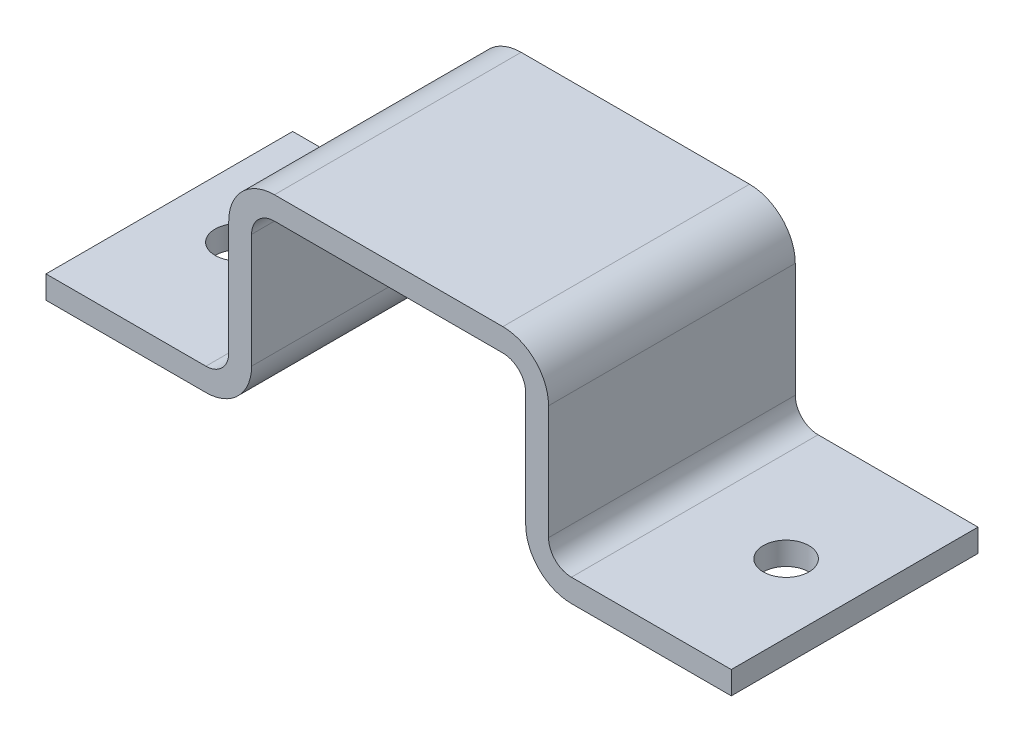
from build123d import *

# Parameters (mm, degrees)
EXTRUDE_THIN1_DEPTH = 27
CUT_EXTRUDE1_REACH  = 91.185
SKETCH4_R           = 5


with BuildPart() as part:
    # Sketch3 → Extrude-Thin1 (new, symmetric)
    with BuildSketch(Plane.XY):
        with BuildLine():
            Line((-75, -40), (-40, -40))
            ThreePointArc((-40, -40), (-32.928932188, -37.071067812), (-30, -30))
            Line((-30, -30), (-30, -5))
            ThreePointArc((-30, -5), (-28.535533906, -1.464466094), (-25, 0))
            Line((-25, 0), (25, 0))
            ThreePointArc((25, 0), (28.535533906, -1.464466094), (30, -5))
            Line((30, -5), (30, -30))
            ThreePointArc((30, -30), (32.928932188, -37.071067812), (40, -40))
            Line((40, -40), (75, -40))
            Line((75, -40), (75, -35))
            Line((75, -35), (40, -35))
            ThreePointArc((40, -35), (36.464466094, -33.535533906), (35, -30))
            Line((35, -30), (35, -5))
            ThreePointArc((35, -5), (32.071067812, 2.071067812), (25, 5))
            Line((25, 5), (-25, 5))
            ThreePointArc((-25, 5), (-32.071067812, 2.071067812), (-35, -5))
            Line((-35, -5), (-35, -30))
            ThreePointArc((-35, -30), (-36.464466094, -33.535533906), (-40, -35))
            Line((-40, -35), (-75, -35))
            Line((-75, -35), (-75, -40))
        make_face()
    extrude(amount=EXTRUDE_THIN1_DEPTH, both=True)

    # Sketch4 → Cut-Extrude1 (cut, up to next)
    with BuildSketch(Plane(origin=(0, -35, 0), x_dir=(1, 0, 0), z_dir=(0, 1, 0)), mode=Mode.PRIVATE) as cut_extrude1_sk1:
        with Locations(Location((-60, 0, 0), (0, 0, 270))):
            Circle(SKETCH4_R)
    cut_extrude1_tool1 = extrude(cut_extrude1_sk1.sketch, amount=-CUT_EXTRUDE1_REACH, mode=Mode.PRIVATE) & part.part
    cut_extrude1 = cut_extrude1_tool1.solids().sort_by_distance((-60, -35, 0))[0]
    add(cut_extrude1, mode=Mode.SUBTRACT)

    # Mirror1: Cut-Extrude1 across plane
    add(cut_extrude1.mirror(Plane(origin=(0, 0, 0), x_dir=(0, 0, 1), z_dir=(1, 0, 0))), mode=Mode.SUBTRACT)


solid = part.part
